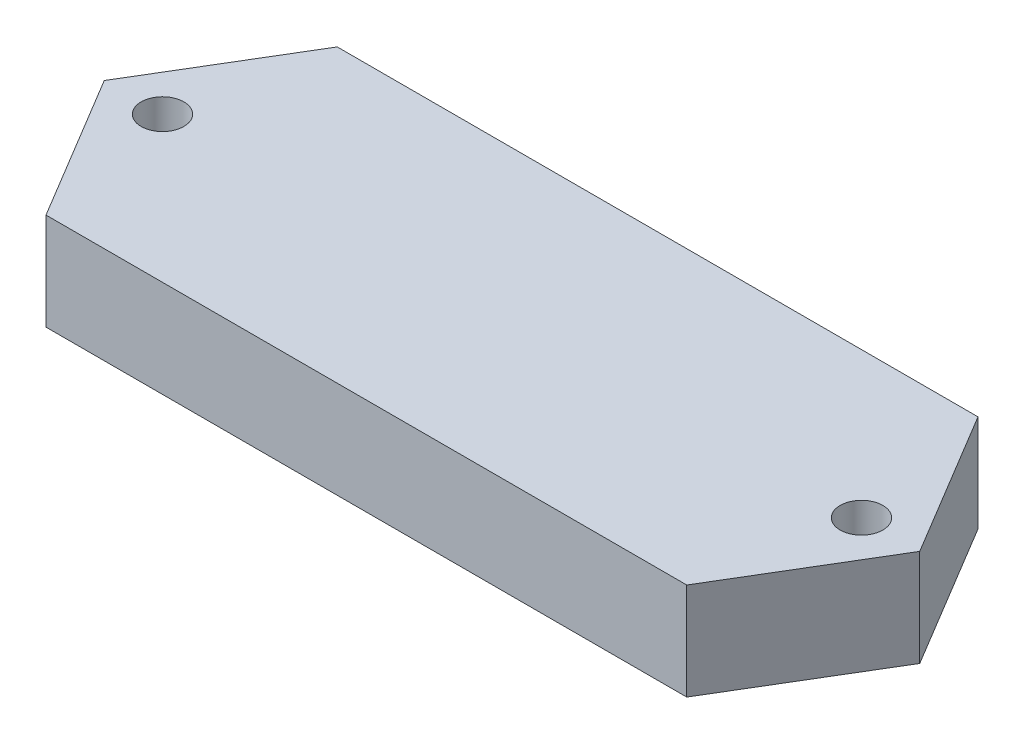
ISO-10303-21;
HEADER;
FILE_DESCRIPTION(('STEP AP214'),'2;1');
FILE_NAME('part.step','',(''),(''),'','','');
FILE_SCHEMA(('AUTOMOTIVE_DESIGN { 1 0 10303 214 1 1 1 1 }'));
ENDSEC;
DATA;
#1=APPLICATION_CONTEXT('core data for automotive mechanical design processes');
#2=APPLICATION_PROTOCOL_DEFINITION('international standard','automotive_design',2000,#1);
#3=PRODUCT_CONTEXT('',#1,'mechanical');
#4=PRODUCT('Part','Part','',(#3));
#5=PRODUCT_RELATED_PRODUCT_CATEGORY('part','',(#4));
#6=PRODUCT_DEFINITION_FORMATION('','',#4);
#7=PRODUCT_DEFINITION_CONTEXT('part definition',#1,'design');
#8=PRODUCT_DEFINITION('design','',#6,#7);
#9=PRODUCT_DEFINITION_SHAPE('','',#8);
#10=(LENGTH_UNIT() NAMED_UNIT(*) SI_UNIT(.MILLI.,.METRE.));
#11=(NAMED_UNIT(*) PLANE_ANGLE_UNIT() SI_UNIT($,.RADIAN.));
#12=(NAMED_UNIT(*) SI_UNIT($,.STERADIAN.) SOLID_ANGLE_UNIT());
#13=UNCERTAINTY_MEASURE_WITH_UNIT(LENGTH_MEASURE(1.E-05),#10,'distance_accuracy_value','');
#14=(GEOMETRIC_REPRESENTATION_CONTEXT(3) GLOBAL_UNCERTAINTY_ASSIGNED_CONTEXT((#13)) GLOBAL_UNIT_ASSIGNED_CONTEXT((#10,
#11,#12)) REPRESENTATION_CONTEXT('',''));
#15=CARTESIAN_POINT('',(0.,0.,0.));
#16=DIRECTION('',(0.,0.,1.));
#17=DIRECTION('',(1.,0.,0.));
#18=AXIS2_PLACEMENT_3D('',#15,#16,#17);
#19=CARTESIAN_POINT('',(0.,5.,-7.5));
#20=DIRECTION('',(0.,0.,1.));
#21=DIRECTION('',(1.,0.,0.));
#22=AXIS2_PLACEMENT_3D('',#19,#20,#21);
#23=PLANE('',#22);
#24=DIRECTION('',(-1.,0.,0.));
#25=VECTOR('',#24,1.);
#26=CARTESIAN_POINT('',(0.,0.,-7.5));
#27=LINE('',#26,#25);
#28=CARTESIAN_POINT('',(16.5,0.,-7.5));
#29=VERTEX_POINT('',#28);
#30=CARTESIAN_POINT('',(-16.5,0.,-7.5));
#31=VERTEX_POINT('',#30);
#32=EDGE_CURVE('E147',#29,#31,#27,.T.);
#33=ORIENTED_EDGE('',*,*,#32,.T.);
#34=DIRECTION('',(0.,-1.,0.));
#35=VECTOR('',#34,1.);
#36=CARTESIAN_POINT('',(-16.5,5.,-7.5));
#37=LINE('',#36,#35);
#38=CARTESIAN_POINT('',(-16.5,5.,-7.5));
#39=VERTEX_POINT('',#38);
#40=EDGE_CURVE('E11',#39,#31,#37,.T.);
#41=ORIENTED_EDGE('',*,*,#40,.F.);
#42=DIRECTION('',(-1.,0.,0.));
#43=VECTOR('',#42,1.);
#44=CARTESIAN_POINT('',(0.,5.,-7.5));
#45=LINE('',#44,#43);
#46=CARTESIAN_POINT('',(16.5,5.,-7.5));
#47=VERTEX_POINT('',#46);
#48=EDGE_CURVE('E98',#47,#39,#45,.T.);
#49=ORIENTED_EDGE('',*,*,#48,.F.);
#50=DIRECTION('',(0.,-1.,0.));
#51=VECTOR('',#50,1.);
#52=CARTESIAN_POINT('',(16.5,5.,-7.5));
#53=LINE('',#52,#51);
#54=EDGE_CURVE('E146',#47,#29,#53,.T.);
#55=ORIENTED_EDGE('',*,*,#54,.T.);
#56=EDGE_LOOP('',(#33,#41,#49,#55));
#57=FACE_BOUND('',#56,.T.);
#58=ADVANCED_FACE('F48',(#57),#23,.F.);
#59=CARTESIAN_POINT('',(-15.4411764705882,5.,-9.26470588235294));
#60=DIRECTION('',(-0.857492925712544,0.,-0.514495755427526));
#61=DIRECTION('',(-0.514495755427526,0.,0.857492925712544));
#62=AXIS2_PLACEMENT_3D('',#59,#60,#61);
#63=PLANE('',#62);
#64=DIRECTION('',(0.514495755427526,0.,-0.857492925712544));
#65=VECTOR('',#64,1.);
#66=CARTESIAN_POINT('',(-15.4411764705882,0.,-9.26470588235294));
#67=LINE('',#66,#65);
#68=CARTESIAN_POINT('',(-21.,0.,0.));
#69=VERTEX_POINT('',#68);
#70=EDGE_CURVE('E151',#69,#31,#67,.T.);
#71=ORIENTED_EDGE('',*,*,#70,.F.);
#72=DIRECTION('',(0.,-1.,0.));
#73=VECTOR('',#72,1.);
#74=CARTESIAN_POINT('',(-21.,5.,0.));
#75=LINE('',#74,#73);
#76=CARTESIAN_POINT('',(-21.,5.,0.));
#77=VERTEX_POINT('',#76);
#78=EDGE_CURVE('E57',#77,#69,#75,.T.);
#79=ORIENTED_EDGE('',*,*,#78,.F.);
#80=DIRECTION('',(0.514495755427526,0.,-0.857492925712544));
#81=VECTOR('',#80,1.);
#82=CARTESIAN_POINT('',(-15.4411764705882,5.,-9.26470588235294));
#83=LINE('',#82,#81);
#84=EDGE_CURVE('E132',#77,#39,#83,.T.);
#85=ORIENTED_EDGE('',*,*,#84,.T.);
#86=ORIENTED_EDGE('',*,*,#40,.T.);
#87=EDGE_LOOP('',(#71,#79,#85,#86));
#88=FACE_BOUND('',#87,.T.);
#89=ADVANCED_FACE('F185',(#88),#63,.T.);
#90=CARTESIAN_POINT('',(-15.4411764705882,5.,9.26470588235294));
#91=DIRECTION('',(-0.857492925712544,0.,0.514495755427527));
#92=DIRECTION('',(0.514495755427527,0.,0.857492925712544));
#93=AXIS2_PLACEMENT_3D('',#90,#91,#92);
#94=PLANE('',#93);
#95=DIRECTION('',(-0.514495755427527,0.,-0.857492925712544));
#96=VECTOR('',#95,1.);
#97=CARTESIAN_POINT('',(-15.4411764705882,0.,9.26470588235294));
#98=LINE('',#97,#96);
#99=CARTESIAN_POINT('',(-16.5,0.,7.5));
#100=VERTEX_POINT('',#99);
#101=EDGE_CURVE('E155',#100,#69,#98,.T.);
#102=ORIENTED_EDGE('',*,*,#101,.F.);
#103=DIRECTION('',(0.,-1.,0.));
#104=VECTOR('',#103,1.);
#105=CARTESIAN_POINT('',(-16.5,5.,7.5));
#106=LINE('',#105,#104);
#107=CARTESIAN_POINT('',(-16.5,5.,7.5));
#108=VERTEX_POINT('',#107);
#109=EDGE_CURVE('E117',#108,#100,#106,.T.);
#110=ORIENTED_EDGE('',*,*,#109,.F.);
#111=DIRECTION('',(-0.514495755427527,0.,-0.857492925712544));
#112=VECTOR('',#111,1.);
#113=CARTESIAN_POINT('',(-15.4411764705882,5.,9.26470588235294));
#114=LINE('',#113,#112);
#115=EDGE_CURVE('E128',#108,#77,#114,.T.);
#116=ORIENTED_EDGE('',*,*,#115,.T.);
#117=ORIENTED_EDGE('',*,*,#78,.T.);
#118=EDGE_LOOP('',(#102,#110,#116,#117));
#119=FACE_BOUND('',#118,.T.);
#120=ADVANCED_FACE('F182',(#119),#94,.T.);
#121=CARTESIAN_POINT('',(0.,5.,7.5));
#122=DIRECTION('',(0.,0.,1.));
#123=DIRECTION('',(1.,0.,0.));
#124=AXIS2_PLACEMENT_3D('',#121,#122,#123);
#125=PLANE('',#124);
#126=DIRECTION('',(-1.,0.,0.));
#127=VECTOR('',#126,1.);
#128=CARTESIAN_POINT('',(0.,0.,7.5));
#129=LINE('',#128,#127);
#130=CARTESIAN_POINT('',(16.5,0.,7.5));
#131=VERTEX_POINT('',#130);
#132=EDGE_CURVE('E115',#131,#100,#129,.T.);
#133=ORIENTED_EDGE('',*,*,#132,.F.);
#134=DIRECTION('',(0.,-1.,0.));
#135=VECTOR('',#134,1.);
#136=CARTESIAN_POINT('',(16.5,5.,7.5));
#137=LINE('',#136,#135);
#138=CARTESIAN_POINT('',(16.5,5.,7.5));
#139=VERTEX_POINT('',#138);
#140=EDGE_CURVE('E109',#139,#131,#137,.T.);
#141=ORIENTED_EDGE('',*,*,#140,.F.);
#142=DIRECTION('',(-1.,0.,0.));
#143=VECTOR('',#142,1.);
#144=CARTESIAN_POINT('',(0.,5.,7.5));
#145=LINE('',#144,#143);
#146=EDGE_CURVE('E113',#139,#108,#145,.T.);
#147=ORIENTED_EDGE('',*,*,#146,.T.);
#148=ORIENTED_EDGE('',*,*,#109,.T.);
#149=EDGE_LOOP('',(#133,#141,#147,#148));
#150=FACE_BOUND('',#149,.T.);
#151=ADVANCED_FACE('F111',(#150),#125,.T.);
#152=CARTESIAN_POINT('',(15.4411764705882,5.,9.26470588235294));
#153=DIRECTION('',(-0.857492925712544,0.,-0.514495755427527));
#154=DIRECTION('',(-0.514495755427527,0.,0.857492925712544));
#155=AXIS2_PLACEMENT_3D('',#152,#153,#154);
#156=PLANE('',#155);
#157=DIRECTION('',(0.514495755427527,0.,-0.857492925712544));
#158=VECTOR('',#157,1.);
#159=CARTESIAN_POINT('',(15.4411764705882,0.,9.26470588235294));
#160=LINE('',#159,#158);
#161=CARTESIAN_POINT('',(21.,0.,0.));
#162=VERTEX_POINT('',#161);
#163=EDGE_CURVE('E86',#131,#162,#160,.T.);
#164=ORIENTED_EDGE('',*,*,#163,.T.);
#165=DIRECTION('',(0.,-1.,0.));
#166=VECTOR('',#165,1.);
#167=CARTESIAN_POINT('',(21.,5.,0.));
#168=LINE('',#167,#166);
#169=CARTESIAN_POINT('',(21.,5.,0.));
#170=VERTEX_POINT('',#169);
#171=EDGE_CURVE('E118',#170,#162,#168,.T.);
#172=ORIENTED_EDGE('',*,*,#171,.F.);
#173=DIRECTION('',(0.514495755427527,0.,-0.857492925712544));
#174=VECTOR('',#173,1.);
#175=CARTESIAN_POINT('',(15.4411764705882,5.,9.26470588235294));
#176=LINE('',#175,#174);
#177=EDGE_CURVE('E120',#139,#170,#176,.T.);
#178=ORIENTED_EDGE('',*,*,#177,.F.);
#179=ORIENTED_EDGE('',*,*,#140,.T.);
#180=EDGE_LOOP('',(#164,#172,#178,#179));
#181=FACE_BOUND('',#180,.T.);
#182=ADVANCED_FACE('F121',(#181),#156,.F.);
#183=CARTESIAN_POINT('',(18.,5.,0.));
#184=DIRECTION('',(0.,-1.,0.));
#185=DIRECTION('',(0.,0.,-1.));
#186=AXIS2_PLACEMENT_3D('',#183,#184,#185);
#187=CYLINDRICAL_SURFACE('',#186,1.1);
#188=CARTESIAN_POINT('',(18.,5.,0.));
#189=DIRECTION('',(0.,1.,0.));
#190=DIRECTION('',(0.,0.,1.));
#191=AXIS2_PLACEMENT_3D('',#188,#189,#190);
#192=CIRCLE('',#191,1.1);
#193=CARTESIAN_POINT('',(18.,5.,1.1));
#194=VERTEX_POINT('',#193);
#195=EDGE_CURVE('E138',#194,#194,#192,.F.);
#196=ORIENTED_EDGE('',*,*,#195,.F.);
#197=EDGE_LOOP('',(#196));
#198=FACE_BOUND('',#197,.T.);
#199=CARTESIAN_POINT('',(18.,0.,0.));
#200=DIRECTION('',(0.,1.,0.));
#201=DIRECTION('',(0.,0.,1.));
#202=AXIS2_PLACEMENT_3D('',#199,#200,#201);
#203=CIRCLE('',#202,1.1);
#204=CARTESIAN_POINT('',(18.,0.,1.1));
#205=VERTEX_POINT('',#204);
#206=EDGE_CURVE('E165',#205,#205,#203,.F.);
#207=ORIENTED_EDGE('',*,*,#206,.T.);
#208=EDGE_LOOP('',(#207));
#209=FACE_BOUND('',#208,.T.);
#210=ADVANCED_FACE('F194',(#198,#209),#187,.F.);
#211=CARTESIAN_POINT('',(15.4411764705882,5.,-9.26470588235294));
#212=DIRECTION('',(-0.857492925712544,0.,0.514495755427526));
#213=DIRECTION('',(0.514495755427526,0.,0.857492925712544));
#214=AXIS2_PLACEMENT_3D('',#211,#212,#213);
#215=PLANE('',#214);
#216=DIRECTION('',(-0.514495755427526,0.,-0.857492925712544));
#217=VECTOR('',#216,1.);
#218=CARTESIAN_POINT('',(15.4411764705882,0.,-9.26470588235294));
#219=LINE('',#218,#217);
#220=EDGE_CURVE('E92',#162,#29,#219,.T.);
#221=ORIENTED_EDGE('',*,*,#220,.T.);
#222=ORIENTED_EDGE('',*,*,#54,.F.);
#223=DIRECTION('',(-0.514495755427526,0.,-0.857492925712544));
#224=VECTOR('',#223,1.);
#225=CARTESIAN_POINT('',(15.4411764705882,5.,-9.26470588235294));
#226=LINE('',#225,#224);
#227=EDGE_CURVE('E65',#170,#47,#226,.T.);
#228=ORIENTED_EDGE('',*,*,#227,.F.);
#229=ORIENTED_EDGE('',*,*,#171,.T.);
#230=EDGE_LOOP('',(#221,#222,#228,#229));
#231=FACE_BOUND('',#230,.T.);
#232=ADVANCED_FACE('F191',(#231),#215,.F.);
#233=CARTESIAN_POINT('',(-18.,5.,0.));
#234=DIRECTION('',(0.,-1.,0.));
#235=DIRECTION('',(0.,0.,-1.));
#236=AXIS2_PLACEMENT_3D('',#233,#234,#235);
#237=CYLINDRICAL_SURFACE('',#236,1.1);
#238=CARTESIAN_POINT('',(-18.,5.,0.));
#239=DIRECTION('',(0.,1.,0.));
#240=DIRECTION('',(0.,0.,1.));
#241=AXIS2_PLACEMENT_3D('',#238,#239,#240);
#242=CIRCLE('',#241,1.1);
#243=CARTESIAN_POINT('',(-18.,5.,1.1));
#244=VERTEX_POINT('',#243);
#245=EDGE_CURVE('E142',#244,#244,#242,.T.);
#246=ORIENTED_EDGE('',*,*,#245,.T.);
#247=EDGE_LOOP('',(#246));
#248=FACE_BOUND('',#247,.T.);
#249=CARTESIAN_POINT('',(-18.,0.,0.));
#250=DIRECTION('',(0.,1.,0.));
#251=DIRECTION('',(0.,0.,1.));
#252=AXIS2_PLACEMENT_3D('',#249,#250,#251);
#253=CIRCLE('',#252,1.1);
#254=CARTESIAN_POINT('',(-18.,0.,1.1));
#255=VERTEX_POINT('',#254);
#256=EDGE_CURVE('E169',#255,#255,#253,.T.);
#257=ORIENTED_EDGE('',*,*,#256,.F.);
#258=EDGE_LOOP('',(#257));
#259=FACE_BOUND('',#258,.T.);
#260=ADVANCED_FACE('F193',(#248,#259),#237,.F.);
#261=CARTESIAN_POINT('',(0.,5.,0.));
#262=DIRECTION('',(0.,1.,0.));
#263=DIRECTION('',(0.,0.,1.));
#264=AXIS2_PLACEMENT_3D('',#261,#262,#263);
#265=PLANE('',#264);
#266=ORIENTED_EDGE('',*,*,#48,.T.);
#267=ORIENTED_EDGE('',*,*,#84,.F.);
#268=ORIENTED_EDGE('',*,*,#115,.F.);
#269=ORIENTED_EDGE('',*,*,#146,.F.);
#270=ORIENTED_EDGE('',*,*,#177,.T.);
#271=ORIENTED_EDGE('',*,*,#227,.T.);
#272=EDGE_LOOP('',(#266,#267,#268,#269,#270,#271));
#273=FACE_BOUND('',#272,.T.);
#274=ORIENTED_EDGE('',*,*,#195,.T.);
#275=EDGE_LOOP('',(#274));
#276=FACE_BOUND('',#275,.T.);
#277=ORIENTED_EDGE('',*,*,#245,.F.);
#278=EDGE_LOOP('',(#277));
#279=FACE_BOUND('',#278,.T.);
#280=ADVANCED_FACE('F125',(#273,#276,#279),#265,.T.);
#281=CARTESIAN_POINT('',(0.,0.,0.));
#282=DIRECTION('',(0.,1.,0.));
#283=DIRECTION('',(0.,0.,1.));
#284=AXIS2_PLACEMENT_3D('',#281,#282,#283);
#285=PLANE('',#284);
#286=ORIENTED_EDGE('',*,*,#32,.F.);
#287=ORIENTED_EDGE('',*,*,#220,.F.);
#288=ORIENTED_EDGE('',*,*,#163,.F.);
#289=ORIENTED_EDGE('',*,*,#132,.T.);
#290=ORIENTED_EDGE('',*,*,#101,.T.);
#291=ORIENTED_EDGE('',*,*,#70,.T.);
#292=EDGE_LOOP('',(#286,#287,#288,#289,#290,#291));
#293=FACE_BOUND('',#292,.T.);
#294=ORIENTED_EDGE('',*,*,#206,.F.);
#295=EDGE_LOOP('',(#294));
#296=FACE_BOUND('',#295,.T.);
#297=ORIENTED_EDGE('',*,*,#256,.T.);
#298=EDGE_LOOP('',(#297));
#299=FACE_BOUND('',#298,.T.);
#300=ADVANCED_FACE('F188',(#293,#296,#299),#285,.F.);
#301=CLOSED_SHELL('',(#58,#89,#120,#151,#182,#210,#232,#260,#280,#300));
#302=MANIFOLD_SOLID_BREP('B2',#301);
#303=ADVANCED_BREP_SHAPE_REPRESENTATION('',(#18,#302),#14);
#304=SHAPE_DEFINITION_REPRESENTATION(#9,#303);
ENDSEC;
END-ISO-10303-21;
